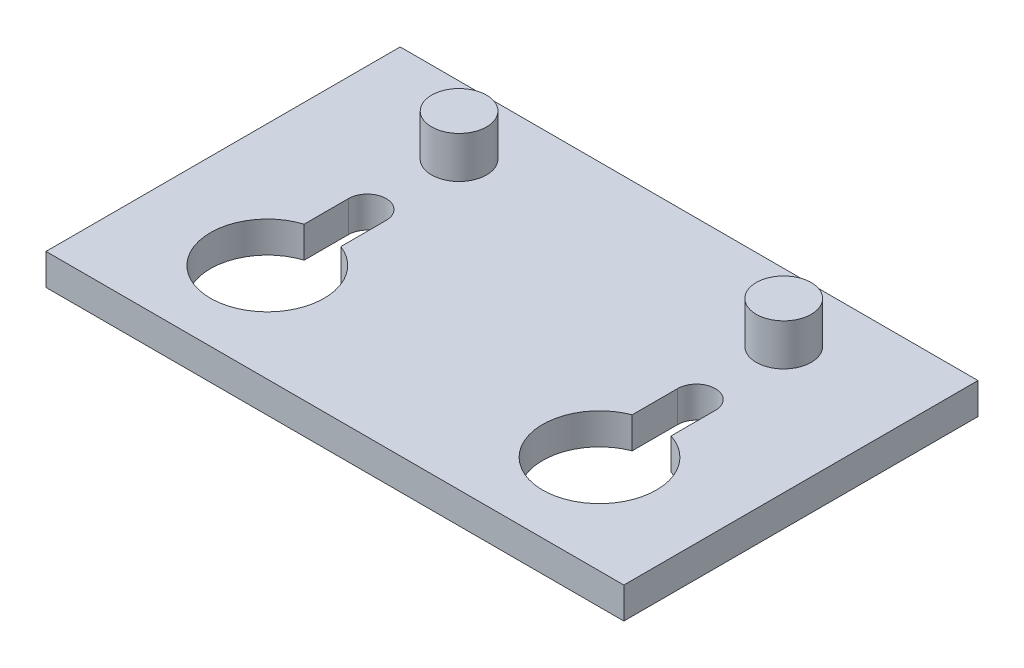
from build123d import *

# Parameters (mm, degrees)
SKETCH1_W          = 140.940304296
SKETCH1_H          = 86.38276715
EXTRUDE1_DEPTH     = 7.62
CUT_EXTRUDE1_DEPTH = 84.003628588
SKETCH3_R          = 6.70951587
EXTRUDE2_DEPTH     = 10.16


with BuildPart() as part:
    # Sketch1 → Extrude1 (new body)
    with BuildSketch(Plane(origin=(0, 0, 0), x_dir=(1, 0, 0), z_dir=(0, 1, 0))):
        Rectangle(SKETCH1_W, SKETCH1_H)
    extrude(amount=EXTRUDE1_DEPTH)

    # Sketch2 → Cut-Extrude1 (cut, through all)
    with BuildSketch(Plane(origin=(0, 7.62, 0), x_dir=(-1, 0, 0), z_dir=(0, 1, 0))):
        with BuildLine():
            Line((35.533598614, -4.857710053), (35.533598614, 6.215630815))
            ThreePointArc((35.533598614, 6.215630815), (40.910148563, 33.036624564), (44.74351916, 5.951974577))
            Line((44.74351916, 5.951974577), (44.74351916, -4.857710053))
            ThreePointArc((44.74351916, -4.857710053), (40.138558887, -9.462670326), (35.533598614, -4.857710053))
        make_face()
    cut_extrude1 = extrude(amount=-CUT_EXTRUDE1_DEPTH, mode=Mode.SUBTRACT)

    # Sketch3 → Extrude2 (add)
    with BuildSketch(Plane(origin=(0, 7.62, 0), x_dir=(-1, 0, 0), z_dir=(0, 1, 0))):
        with Locations(Location((39.59006219, -26.684050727, 0), (0, 0, 90))):
            Circle(SKETCH3_R)
    extrude2 = extrude(amount=EXTRUDE2_DEPTH)

    # Mirror2: Cut-Extrude1, Extrude2 across plane
    add(cut_extrude1.mirror(Plane(origin=(0, 0, 0), x_dir=(0, 0, 1), z_dir=(1, 0, 0))), mode=Mode.SUBTRACT)
    add(extrude2.mirror(Plane(origin=(0, 0, 0), x_dir=(0, 0, 1), z_dir=(1, 0, 0))))


solid = part.part
